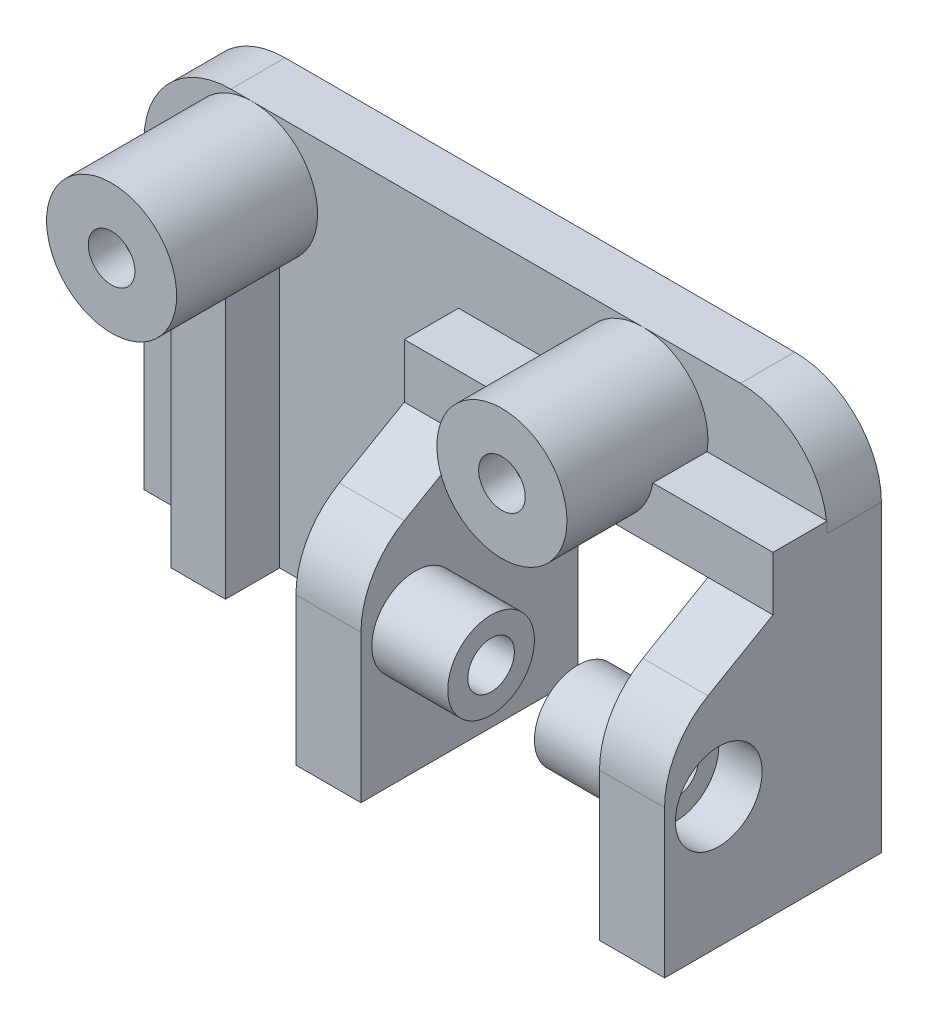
ISO-10303-21;
HEADER;
FILE_DESCRIPTION(('STEP AP214'),'2;1');
FILE_NAME('part.step','',(''),(''),'','','');
FILE_SCHEMA(('AUTOMOTIVE_DESIGN { 1 0 10303 214 1 1 1 1 }'));
ENDSEC;
DATA;
#1=APPLICATION_CONTEXT('core data for automotive mechanical design processes');
#2=APPLICATION_PROTOCOL_DEFINITION('international standard','automotive_design',2000,#1);
#3=PRODUCT_CONTEXT('',#1,'mechanical');
#4=PRODUCT('Part','Part','',(#3));
#5=PRODUCT_RELATED_PRODUCT_CATEGORY('part','',(#4));
#6=PRODUCT_DEFINITION_FORMATION('','',#4);
#7=PRODUCT_DEFINITION_CONTEXT('part definition',#1,'design');
#8=PRODUCT_DEFINITION('design','',#6,#7);
#9=PRODUCT_DEFINITION_SHAPE('','',#8);
#10=(LENGTH_UNIT() NAMED_UNIT(*) SI_UNIT(.MILLI.,.METRE.));
#11=(NAMED_UNIT(*) PLANE_ANGLE_UNIT() SI_UNIT($,.RADIAN.));
#12=(NAMED_UNIT(*) SI_UNIT($,.STERADIAN.) SOLID_ANGLE_UNIT());
#13=UNCERTAINTY_MEASURE_WITH_UNIT(LENGTH_MEASURE(1.E-05),#10,'distance_accuracy_value','');
#14=(GEOMETRIC_REPRESENTATION_CONTEXT(3) GLOBAL_UNCERTAINTY_ASSIGNED_CONTEXT((#13)) GLOBAL_UNIT_ASSIGNED_CONTEXT((#10,
#11,#12)) REPRESENTATION_CONTEXT('',''));
#15=CARTESIAN_POINT('',(0.,0.,0.));
#16=DIRECTION('',(0.,0.,1.));
#17=DIRECTION('',(1.,0.,0.));
#18=AXIS2_PLACEMENT_3D('',#15,#16,#17);
#19=CARTESIAN_POINT('',(8.,28.,5.));
#20=DIRECTION('',(0.,0.,-1.));
#21=DIRECTION('',(-1.,0.,0.));
#22=AXIS2_PLACEMENT_3D('',#19,#20,#21);
#23=PLANE('',#22);
#24=CARTESIAN_POINT('',(10.,30.,5.));
#25=DIRECTION('',(0.,0.,1.));
#26=DIRECTION('',(1.,0.,0.));
#27=AXIS2_PLACEMENT_3D('',#24,#25,#26);
#28=CIRCLE('',#27,6.);
#29=CARTESIAN_POINT('',(12.5,24.5456439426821,5.));
#30=VERTEX_POINT('',#29);
#31=CARTESIAN_POINT('',(10.,36.,5.));
#32=VERTEX_POINT('',#31);
#33=EDGE_CURVE('E498',#30,#32,#28,.T.);
#34=ORIENTED_EDGE('',*,*,#33,.F.);
#35=DIRECTION('',(0.,-1.,0.));
#36=VECTOR('',#35,1.);
#37=CARTESIAN_POINT('',(12.5,36.002,5.));
#38=LINE('',#37,#36);
#39=CARTESIAN_POINT('',(12.5,0.,5.));
#40=VERTEX_POINT('',#39);
#41=EDGE_CURVE('E388',#30,#40,#38,.T.);
#42=ORIENTED_EDGE('',*,*,#41,.T.);
#43=DIRECTION('',(1.,0.,0.));
#44=VECTOR('',#43,1.);
#45=CARTESIAN_POINT('',(0.,0.,5.));
#46=LINE('',#45,#44);
#47=CARTESIAN_POINT('',(29.,0.,5.));
#48=VERTEX_POINT('',#47);
#49=EDGE_CURVE('E515',#40,#48,#46,.T.);
#50=ORIENTED_EDGE('',*,*,#49,.T.);
#51=DIRECTION('',(0.,1.,0.));
#52=VECTOR('',#51,1.);
#53=CARTESIAN_POINT('',(29.,0.,5.));
#54=LINE('',#53,#52);
#55=CARTESIAN_POINT('',(29.,29.,5.));
#56=VERTEX_POINT('',#55);
#57=EDGE_CURVE('E617',#48,#56,#54,.T.);
#58=ORIENTED_EDGE('',*,*,#57,.T.);
#59=DIRECTION('',(1.,0.,0.));
#60=VECTOR('',#59,1.);
#61=CARTESIAN_POINT('',(29.,29.,5.));
#62=LINE('',#61,#60);
#63=CARTESIAN_POINT('',(40.0839202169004,29.,5.));
#64=VERTEX_POINT('',#63);
#65=EDGE_CURVE('E646',#56,#64,#62,.T.);
#66=ORIENTED_EDGE('',*,*,#65,.T.);
#67=CARTESIAN_POINT('',(46.,30.,5.));
#68=DIRECTION('',(0.,0.,1.));
#69=DIRECTION('',(1.,0.,0.));
#70=AXIS2_PLACEMENT_3D('',#67,#68,#69);
#71=CIRCLE('',#70,5.99999999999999);
#72=CARTESIAN_POINT('',(46.,36.,5.));
#73=VERTEX_POINT('',#72);
#74=EDGE_CURVE('E494',#73,#64,#71,.T.);
#75=ORIENTED_EDGE('',*,*,#74,.F.);
#76=DIRECTION('',(-1.,0.,0.));
#77=VECTOR('',#76,1.);
#78=CARTESIAN_POINT('',(8.00000000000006,36.,5.));
#79=LINE('',#78,#77);
#80=EDGE_CURVE('E532',#73,#32,#79,.T.);
#81=ORIENTED_EDGE('',*,*,#80,.T.);
#82=EDGE_LOOP('',(#34,#42,#50,#58,#66,#75,#81));
#83=FACE_BOUND('',#82,.T.);
#84=ADVANCED_FACE('F54',(#83),#23,.F.);
#85=CARTESIAN_POINT('',(29.,0.,5.));
#86=DIRECTION('',(0.,-1.,0.));
#87=DIRECTION('',(0.,0.,-1.));
#88=AXIS2_PLACEMENT_3D('',#85,#86,#87);
#89=PLANE('',#88);
#90=DIRECTION('',(0.,0.,-1.));
#91=VECTOR('',#90,1.);
#92=CARTESIAN_POINT('',(35.,0.,5.));
#93=LINE('',#92,#91);
#94=CARTESIAN_POINT('',(35.,0.,20.));
#95=VERTEX_POINT('',#94);
#96=CARTESIAN_POINT('',(35.,0.,0.));
#97=VERTEX_POINT('',#96);
#98=EDGE_CURVE('E622',#95,#97,#93,.T.);
#99=ORIENTED_EDGE('',*,*,#98,.F.);
#100=DIRECTION('',(1.,0.,0.));
#101=VECTOR('',#100,1.);
#102=CARTESIAN_POINT('',(29.,0.,20.));
#103=LINE('',#102,#101);
#104=CARTESIAN_POINT('',(29.,0.,20.));
#105=VERTEX_POINT('',#104);
#106=EDGE_CURVE('E64',#105,#95,#103,.T.);
#107=ORIENTED_EDGE('',*,*,#106,.F.);
#108=DIRECTION('',(0.,0.,-1.));
#109=VECTOR('',#108,1.);
#110=CARTESIAN_POINT('',(29.,0.,5.));
#111=LINE('',#110,#109);
#112=EDGE_CURVE('E642',#105,#48,#111,.T.);
#113=ORIENTED_EDGE('',*,*,#112,.T.);
#114=ORIENTED_EDGE('',*,*,#49,.F.);
#115=DIRECTION('',(0.,0.,1.));
#116=VECTOR('',#115,1.);
#117=CARTESIAN_POINT('',(12.5,0.,5.));
#118=LINE('',#117,#116);
#119=CARTESIAN_POINT('',(12.5,0.,10.));
#120=VERTEX_POINT('',#119);
#121=EDGE_CURVE('E370',#40,#120,#118,.T.);
#122=ORIENTED_EDGE('',*,*,#121,.T.);
#123=DIRECTION('',(-1.,0.,0.));
#124=VECTOR('',#123,1.);
#125=CARTESIAN_POINT('',(7.5,0.,10.));
#126=LINE('',#125,#124);
#127=CARTESIAN_POINT('',(7.5,0.,10.));
#128=VERTEX_POINT('',#127);
#129=EDGE_CURVE('E366',#120,#128,#126,.T.);
#130=ORIENTED_EDGE('',*,*,#129,.T.);
#131=DIRECTION('',(0.,0.,-1.));
#132=VECTOR('',#131,1.);
#133=CARTESIAN_POINT('',(7.5,0.,5.));
#134=LINE('',#133,#132);
#135=CARTESIAN_POINT('',(7.5,0.,5.));
#136=VERTEX_POINT('',#135);
#137=EDGE_CURVE('E361',#128,#136,#134,.T.);
#138=ORIENTED_EDGE('',*,*,#137,.T.);
#139=CARTESIAN_POINT('',(0.,0.,5.));
#140=VERTEX_POINT('',#139);
#141=EDGE_CURVE('E517',#140,#136,#46,.T.);
#142=ORIENTED_EDGE('',*,*,#141,.F.);
#143=DIRECTION('',(0.,0.,-1.));
#144=VECTOR('',#143,1.);
#145=CARTESIAN_POINT('',(0.,0.,5.));
#146=LINE('',#145,#144);
#147=CARTESIAN_POINT('',(0.,0.,0.));
#148=VERTEX_POINT('',#147);
#149=EDGE_CURVE('E594',#140,#148,#146,.T.);
#150=ORIENTED_EDGE('',*,*,#149,.T.);
#151=DIRECTION('',(1.,0.,0.));
#152=VECTOR('',#151,1.);
#153=CARTESIAN_POINT('',(0.,0.,0.));
#154=LINE('',#153,#152);
#155=EDGE_CURVE('E539',#148,#97,#154,.T.);
#156=ORIENTED_EDGE('',*,*,#155,.T.);
#157=EDGE_LOOP('',(#99,#107,#113,#114,#122,#130,#138,#142,#150,#156));
#158=FACE_BOUND('',#157,.T.);
#159=ADVANCED_FACE('F727',(#158),#89,.T.);
#160=CARTESIAN_POINT('',(29.,0.,20.));
#161=DIRECTION('',(0.,0.,1.));
#162=DIRECTION('',(0.,-1.,0.));
#163=AXIS2_PLACEMENT_3D('',#160,#161,#162);
#164=PLANE('',#163);
#165=DIRECTION('',(0.,-1.,0.));
#166=VECTOR('',#165,1.);
#167=CARTESIAN_POINT('',(35.,0.,20.));
#168=LINE('',#167,#166);
#169=CARTESIAN_POINT('',(35.,13.6076951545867,20.));
#170=VERTEX_POINT('',#169);
#171=EDGE_CURVE('E654',#170,#95,#168,.T.);
#172=ORIENTED_EDGE('',*,*,#171,.F.);
#173=DIRECTION('',(1.,0.,0.));
#174=VECTOR('',#173,1.);
#175=CARTESIAN_POINT('',(29.,13.6076951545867,20.));
#176=LINE('',#175,#174);
#177=CARTESIAN_POINT('',(29.,13.6076951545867,20.));
#178=VERTEX_POINT('',#177);
#179=EDGE_CURVE('E662',#178,#170,#176,.T.);
#180=ORIENTED_EDGE('',*,*,#179,.F.);
#181=DIRECTION('',(0.,-1.,0.));
#182=VECTOR('',#181,1.);
#183=CARTESIAN_POINT('',(29.,0.,20.));
#184=LINE('',#183,#182);
#185=EDGE_CURVE('E638',#178,#105,#184,.T.);
#186=ORIENTED_EDGE('',*,*,#185,.T.);
#187=ORIENTED_EDGE('',*,*,#106,.T.);
#188=EDGE_LOOP('',(#172,#180,#186,#187));
#189=FACE_BOUND('',#188,.T.);
#190=ADVANCED_FACE('F790',(#189),#164,.T.);
#191=CARTESIAN_POINT('',(29.,13.6076951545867,12.));
#192=DIRECTION('',(1.,0.,0.));
#193=DIRECTION('',(0.,0.,-1.));
#194=AXIS2_PLACEMENT_3D('',#191,#192,#193);
#195=CYLINDRICAL_SURFACE('',#194,8.);
#196=CARTESIAN_POINT('',(35.,13.6076951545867,12.));
#197=DIRECTION('',(1.,0.,0.));
#198=DIRECTION('',(0.,0.,-1.));
#199=AXIS2_PLACEMENT_3D('',#196,#197,#198);
#200=CIRCLE('',#199,8.);
#201=CARTESIAN_POINT('',(35.,20.5358983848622,16.));
#202=VERTEX_POINT('',#201);
#203=EDGE_CURVE('E650',#202,#170,#200,.T.);
#204=ORIENTED_EDGE('',*,*,#203,.F.);
#205=DIRECTION('',(1.,0.,0.));
#206=VECTOR('',#205,1.);
#207=CARTESIAN_POINT('',(29.,20.5358983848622,16.));
#208=LINE('',#207,#206);
#209=CARTESIAN_POINT('',(29.,20.5358983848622,16.));
#210=VERTEX_POINT('',#209);
#211=EDGE_CURVE('E665',#210,#202,#208,.T.);
#212=ORIENTED_EDGE('',*,*,#211,.F.);
#213=CARTESIAN_POINT('',(29.,13.6076951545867,12.));
#214=DIRECTION('',(1.,0.,0.));
#215=DIRECTION('',(0.,0.,-1.));
#216=AXIS2_PLACEMENT_3D('',#213,#214,#215);
#217=CIRCLE('',#216,8.);
#218=EDGE_CURVE('E634',#210,#178,#217,.T.);
#219=ORIENTED_EDGE('',*,*,#218,.T.);
#220=ORIENTED_EDGE('',*,*,#179,.T.);
#221=EDGE_LOOP('',(#204,#212,#219,#220));
#222=FACE_BOUND('',#221,.T.);
#223=ADVANCED_FACE('F837',(#222),#195,.T.);
#224=CARTESIAN_POINT('',(29.,24.,10.));
#225=DIRECTION('',(0.,0.866025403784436,0.500000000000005));
#226=DIRECTION('',(0.,-0.500000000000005,0.866025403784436));
#227=AXIS2_PLACEMENT_3D('',#224,#225,#226);
#228=PLANE('',#227);
#229=DIRECTION('',(0.,-0.500000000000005,0.866025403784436));
#230=VECTOR('',#229,1.);
#231=CARTESIAN_POINT('',(35.,24.,10.));
#232=LINE('',#231,#230);
#233=CARTESIAN_POINT('',(35.,24.,10.));
#234=VERTEX_POINT('',#233);
#235=EDGE_CURVE('E605',#234,#202,#232,.T.);
#236=ORIENTED_EDGE('',*,*,#235,.F.);
#237=DIRECTION('',(1.,0.,0.));
#238=VECTOR('',#237,1.);
#239=CARTESIAN_POINT('',(29.,24.,10.));
#240=LINE('',#239,#238);
#241=CARTESIAN_POINT('',(29.,24.,10.));
#242=VERTEX_POINT('',#241);
#243=EDGE_CURVE('E668',#242,#234,#240,.T.);
#244=ORIENTED_EDGE('',*,*,#243,.F.);
#245=DIRECTION('',(0.,-0.500000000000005,0.866025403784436));
#246=VECTOR('',#245,1.);
#247=CARTESIAN_POINT('',(29.,24.,10.));
#248=LINE('',#247,#246);
#249=EDGE_CURVE('E630',#242,#210,#248,.T.);
#250=ORIENTED_EDGE('',*,*,#249,.T.);
#251=ORIENTED_EDGE('',*,*,#211,.T.);
#252=EDGE_LOOP('',(#236,#244,#250,#251));
#253=FACE_BOUND('',#252,.T.);
#254=ADVANCED_FACE('F841',(#253),#228,.T.);
#255=CARTESIAN_POINT('',(29.,24.,10.));
#256=DIRECTION('',(0.,0.,1.));
#257=DIRECTION('',(1.,0.,0.));
#258=AXIS2_PLACEMENT_3D('',#255,#256,#257);
#259=PLANE('',#258);
#260=ORIENTED_EDGE('',*,*,#243,.T.);
#261=DIRECTION('',(-1.,0.,0.));
#262=VECTOR('',#261,1.);
#263=CARTESIAN_POINT('',(63.002,24.,10.));
#264=LINE('',#263,#262);
#265=CARTESIAN_POINT('',(46.,24.,10.));
#266=VERTEX_POINT('',#265);
#267=EDGE_CURVE('E606',#266,#234,#264,.T.);
#268=ORIENTED_EDGE('',*,*,#267,.F.);
#269=CARTESIAN_POINT('',(46.,30.,10.));
#270=DIRECTION('',(0.,0.,-1.));
#271=DIRECTION('',(-1.,0.,0.));
#272=AXIS2_PLACEMENT_3D('',#269,#270,#271);
#273=CIRCLE('',#272,5.99999999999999);
#274=CARTESIAN_POINT('',(40.0839202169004,29.,10.));
#275=VERTEX_POINT('',#274);
#276=EDGE_CURVE('E601',#275,#266,#273,.F.);
#277=ORIENTED_EDGE('',*,*,#276,.F.);
#278=DIRECTION('',(1.,0.,0.));
#279=VECTOR('',#278,1.);
#280=CARTESIAN_POINT('',(29.,29.,10.));
#281=LINE('',#280,#279);
#282=CARTESIAN_POINT('',(29.,29.,10.));
#283=VERTEX_POINT('',#282);
#284=EDGE_CURVE('E672',#283,#275,#281,.T.);
#285=ORIENTED_EDGE('',*,*,#284,.F.);
#286=DIRECTION('',(0.,-1.,0.));
#287=VECTOR('',#286,1.);
#288=CARTESIAN_POINT('',(29.,24.,10.));
#289=LINE('',#288,#287);
#290=EDGE_CURVE('E626',#283,#242,#289,.T.);
#291=ORIENTED_EDGE('',*,*,#290,.T.);
#292=EDGE_LOOP('',(#260,#268,#277,#285,#291));
#293=FACE_BOUND('',#292,.T.);
#294=ADVANCED_FACE('F744',(#293),#259,.T.);
#295=CARTESIAN_POINT('',(29.,29.,5.));
#296=DIRECTION('',(0.,1.,0.));
#297=DIRECTION('',(0.,0.,1.));
#298=AXIS2_PLACEMENT_3D('',#295,#296,#297);
#299=PLANE('',#298);
#300=ORIENTED_EDGE('',*,*,#284,.T.);
#301=DIRECTION('',(0.,0.,-1.));
#302=VECTOR('',#301,1.);
#303=CARTESIAN_POINT('',(40.0839202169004,29.,18.));
#304=LINE('',#303,#302);
#305=EDGE_CURVE('E610',#64,#275,#304,.F.);
#306=ORIENTED_EDGE('',*,*,#305,.F.);
#307=ORIENTED_EDGE('',*,*,#65,.F.);
#308=DIRECTION('',(0.,0.,1.));
#309=VECTOR('',#308,1.);
#310=CARTESIAN_POINT('',(29.,29.,5.));
#311=LINE('',#310,#309);
#312=EDGE_CURVE('E621',#56,#283,#311,.T.);
#313=ORIENTED_EDGE('',*,*,#312,.T.);
#314=EDGE_LOOP('',(#300,#306,#307,#313));
#315=FACE_BOUND('',#314,.T.);
#316=ADVANCED_FACE('F56',(#315),#299,.T.);
#317=CARTESIAN_POINT('',(29.,13.6076951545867,12.));
#318=DIRECTION('',(1.,0.,0.));
#319=DIRECTION('',(0.,0.,-1.));
#320=AXIS2_PLACEMENT_3D('',#317,#318,#319);
#321=PLANE('',#320);
#322=DIRECTION('',(0.,1.,0.));
#323=VECTOR('',#322,1.);
#324=CARTESIAN_POINT('',(29.,9.6905989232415,19.));
#325=LINE('',#324,#323);
#326=CARTESIAN_POINT('',(29.,9.6905989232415,19.));
#327=VERTEX_POINT('',#326);
#328=CARTESIAN_POINT('',(29.,14.3094010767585,19.));
#329=VERTEX_POINT('',#328);
#330=EDGE_CURVE('E312',#327,#329,#325,.T.);
#331=ORIENTED_EDGE('',*,*,#330,.F.);
#332=DIRECTION('',(0.,0.5,0.866025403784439));
#333=VECTOR('',#332,1.);
#334=CARTESIAN_POINT('',(29.,7.381197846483,15.));
#335=LINE('',#334,#333);
#336=CARTESIAN_POINT('',(29.,7.381197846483,15.));
#337=VERTEX_POINT('',#336);
#338=EDGE_CURVE('E71',#337,#327,#335,.T.);
#339=ORIENTED_EDGE('',*,*,#338,.F.);
#340=DIRECTION('',(0.,-0.500000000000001,0.866025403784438));
#341=VECTOR('',#340,1.);
#342=CARTESIAN_POINT('',(29.,9.6905989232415,11.));
#343=LINE('',#342,#341);
#344=CARTESIAN_POINT('',(29.,9.6905989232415,11.));
#345=VERTEX_POINT('',#344);
#346=EDGE_CURVE('E289',#345,#337,#343,.T.);
#347=ORIENTED_EDGE('',*,*,#346,.F.);
#348=DIRECTION('',(0.,-1.,0.));
#349=VECTOR('',#348,1.);
#350=CARTESIAN_POINT('',(29.,14.3094010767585,11.));
#351=LINE('',#350,#349);
#352=CARTESIAN_POINT('',(29.,14.3094010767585,11.));
#353=VERTEX_POINT('',#352);
#354=EDGE_CURVE('E293',#353,#345,#351,.T.);
#355=ORIENTED_EDGE('',*,*,#354,.F.);
#356=DIRECTION('',(0.,-0.5,-0.866025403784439));
#357=VECTOR('',#356,1.);
#358=CARTESIAN_POINT('',(29.,16.618802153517,15.));
#359=LINE('',#358,#357);
#360=CARTESIAN_POINT('',(29.,16.618802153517,15.));
#361=VERTEX_POINT('',#360);
#362=EDGE_CURVE('E319',#361,#353,#359,.T.);
#363=ORIENTED_EDGE('',*,*,#362,.F.);
#364=DIRECTION('',(0.,0.5,-0.866025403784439));
#365=VECTOR('',#364,1.);
#366=CARTESIAN_POINT('',(29.,14.3094010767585,19.));
#367=LINE('',#366,#365);
#368=EDGE_CURVE('E315',#329,#361,#367,.T.);
#369=ORIENTED_EDGE('',*,*,#368,.F.);
#370=EDGE_LOOP('',(#331,#339,#347,#355,#363,#369));
#371=FACE_BOUND('',#370,.T.);
#372=ORIENTED_EDGE('',*,*,#57,.F.);
#373=ORIENTED_EDGE('',*,*,#112,.F.);
#374=ORIENTED_EDGE('',*,*,#185,.F.);
#375=ORIENTED_EDGE('',*,*,#218,.F.);
#376=ORIENTED_EDGE('',*,*,#249,.F.);
#377=ORIENTED_EDGE('',*,*,#290,.F.);
#378=ORIENTED_EDGE('',*,*,#312,.F.);
#379=EDGE_LOOP('',(#372,#373,#374,#375,#376,#377,#378));
#380=FACE_BOUND('',#379,.T.);
#381=ADVANCED_FACE('F738',(#371,#380),#321,.F.);
#382=CARTESIAN_POINT('',(35.,13.6076951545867,12.));
#383=DIRECTION('',(1.,0.,0.));
#384=DIRECTION('',(0.,0.,-1.));
#385=AXIS2_PLACEMENT_3D('',#382,#383,#384);
#386=PLANE('',#385);
#387=CARTESIAN_POINT('',(35.,12.,15.));
#388=DIRECTION('',(1.,0.,0.));
#389=DIRECTION('',(0.,0.,-1.));
#390=AXIS2_PLACEMENT_3D('',#387,#388,#389);
#391=CIRCLE('',#390,4.);
#392=CARTESIAN_POINT('',(35.,12.,11.));
#393=VERTEX_POINT('',#392);
#394=EDGE_CURVE('E345',#393,#393,#391,.T.);
#395=ORIENTED_EDGE('',*,*,#394,.F.);
#396=EDGE_LOOP('',(#395));
#397=FACE_BOUND('',#396,.T.);
#398=DIRECTION('',(0.,0.,-1.));
#399=VECTOR('',#398,1.);
#400=CARTESIAN_POINT('',(35.,24.,5.));
#401=LINE('',#400,#399);
#402=CARTESIAN_POINT('',(35.,24.,0.));
#403=VERTEX_POINT('',#402);
#404=EDGE_CURVE('E602',#234,#403,#401,.T.);
#405=ORIENTED_EDGE('',*,*,#404,.F.);
#406=ORIENTED_EDGE('',*,*,#235,.T.);
#407=ORIENTED_EDGE('',*,*,#203,.T.);
#408=ORIENTED_EDGE('',*,*,#171,.T.);
#409=ORIENTED_EDGE('',*,*,#98,.T.);
#410=DIRECTION('',(0.,1.,0.));
#411=VECTOR('',#410,1.);
#412=CARTESIAN_POINT('',(35.,0.,0.));
#413=LINE('',#412,#411);
#414=EDGE_CURVE('E543',#97,#403,#413,.T.);
#415=ORIENTED_EDGE('',*,*,#414,.T.);
#416=EDGE_LOOP('',(#405,#406,#407,#408,#409,#415));
#417=FACE_BOUND('',#416,.T.);
#418=ADVANCED_FACE('F828',(#397,#417),#386,.T.);
#419=CARTESIAN_POINT('',(63.002,24.,5.));
#420=DIRECTION('',(0.,1.,0.));
#421=DIRECTION('',(0.,0.,1.));
#422=AXIS2_PLACEMENT_3D('',#419,#420,#421);
#423=PLANE('',#422);
#424=DIRECTION('',(1.,0.,0.));
#425=VECTOR('',#424,1.);
#426=CARTESIAN_POINT('',(-0.002000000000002,24.,10.));
#427=LINE('',#426,#425);
#428=CARTESIAN_POINT('',(57.,24.,10.));
#429=VERTEX_POINT('',#428);
#430=EDGE_CURVE('E453',#266,#429,#427,.T.);
#431=ORIENTED_EDGE('',*,*,#430,.F.);
#432=ORIENTED_EDGE('',*,*,#267,.T.);
#433=ORIENTED_EDGE('',*,*,#404,.T.);
#434=DIRECTION('',(1.,0.,0.));
#435=VECTOR('',#434,1.);
#436=CARTESIAN_POINT('',(35.,24.,0.));
#437=LINE('',#436,#435);
#438=CARTESIAN_POINT('',(57.,24.,0.));
#439=VERTEX_POINT('',#438);
#440=EDGE_CURVE('E547',#403,#439,#437,.T.);
#441=ORIENTED_EDGE('',*,*,#440,.T.);
#442=DIRECTION('',(0.,0.,-1.));
#443=VECTOR('',#442,1.);
#444=CARTESIAN_POINT('',(57.,24.,5.));
#445=LINE('',#444,#443);
#446=EDGE_CURVE('E590',#429,#439,#445,.T.);
#447=ORIENTED_EDGE('',*,*,#446,.F.);
#448=EDGE_LOOP('',(#431,#432,#433,#441,#447));
#449=FACE_BOUND('',#448,.T.);
#450=ADVANCED_FACE('F751',(#449),#423,.F.);
#451=DIRECTION('',(1.,0.,0.));
#452=VECTOR('',#451,1.);
#453=CARTESIAN_POINT('',(-0.002000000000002,29.,5.));
#454=LINE('',#453,#452);
#455=CARTESIAN_POINT('',(51.9160797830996,29.,5.));
#456=VERTEX_POINT('',#455);
#457=CARTESIAN_POINT('',(62.9372539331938,29.,5.));
#458=VERTEX_POINT('',#457);
#459=EDGE_CURVE('E446',#456,#458,#454,.T.);
#460=ORIENTED_EDGE('',*,*,#459,.T.);
#461=CARTESIAN_POINT('',(55.,28.,5.));
#462=DIRECTION('',(0.,0.,1.));
#463=DIRECTION('',(-1.,0.,0.));
#464=AXIS2_PLACEMENT_3D('',#461,#462,#463);
#465=CIRCLE('',#464,8.);
#466=CARTESIAN_POINT('',(54.9999999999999,36.,5.));
#467=VERTEX_POINT('',#466);
#468=EDGE_CURVE('E521',#458,#467,#465,.T.);
#469=ORIENTED_EDGE('',*,*,#468,.T.);
#470=EDGE_CURVE('E527',#467,#73,#79,.T.);
#471=ORIENTED_EDGE('',*,*,#470,.T.);
#472=CARTESIAN_POINT('',(46.,30.,5.));
#473=DIRECTION('',(0.,0.,-1.));
#474=DIRECTION('',(-1.,0.,0.));
#475=AXIS2_PLACEMENT_3D('',#472,#473,#474);
#476=CIRCLE('',#475,5.99999999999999);
#477=EDGE_CURVE('E598',#456,#73,#476,.F.);
#478=ORIENTED_EDGE('',*,*,#477,.F.);
#479=EDGE_LOOP('',(#460,#469,#471,#478));
#480=FACE_BOUND('',#479,.T.);
#481=ADVANCED_FACE('F692',(#480),#23,.F.);
#482=CARTESIAN_POINT('',(46.,30.,18.));
#483=DIRECTION('',(0.,0.,-1.));
#484=DIRECTION('',(-1.,0.,0.));
#485=AXIS2_PLACEMENT_3D('',#482,#483,#484);
#486=CYLINDRICAL_SURFACE('',#485,5.99999999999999);
#487=ORIENTED_EDGE('',*,*,#276,.T.);
#488=CARTESIAN_POINT('',(46.,30.,10.));
#489=DIRECTION('',(0.,0.,-1.));
#490=DIRECTION('',(-1.,0.,0.));
#491=AXIS2_PLACEMENT_3D('',#488,#489,#490);
#492=CIRCLE('',#491,5.99999999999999);
#493=CARTESIAN_POINT('',(51.9160797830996,29.,10.));
#494=VERTEX_POINT('',#493);
#495=EDGE_CURVE('E457',#266,#494,#492,.F.);
#496=ORIENTED_EDGE('',*,*,#495,.T.);
#497=DIRECTION('',(0.,0.,-1.));
#498=VECTOR('',#497,1.);
#499=CARTESIAN_POINT('',(51.9160797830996,29.,18.));
#500=LINE('',#499,#498);
#501=EDGE_CURVE('E433',#494,#456,#500,.T.);
#502=ORIENTED_EDGE('',*,*,#501,.T.);
#503=ORIENTED_EDGE('',*,*,#477,.T.);
#504=ORIENTED_EDGE('',*,*,#74,.T.);
#505=ORIENTED_EDGE('',*,*,#305,.T.);
#506=EDGE_LOOP('',(#487,#496,#502,#503,#504,#505));
#507=FACE_BOUND('',#506,.T.);
#508=CARTESIAN_POINT('',(46.,30.,18.));
#509=DIRECTION('',(0.,0.,1.));
#510=DIRECTION('',(1.,0.,0.));
#511=AXIS2_PLACEMENT_3D('',#508,#509,#510);
#512=CIRCLE('',#511,5.99999999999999);
#513=CARTESIAN_POINT('',(52.,30.,18.));
#514=VERTEX_POINT('',#513);
#515=EDGE_CURVE('E482',#514,#514,#512,.T.);
#516=ORIENTED_EDGE('',*,*,#515,.F.);
#517=EDGE_LOOP('',(#516));
#518=FACE_BOUND('',#517,.T.);
#519=ADVANCED_FACE('F686',(#507,#518),#486,.T.);
#520=CARTESIAN_POINT('',(0.,0.,5.));
#521=DIRECTION('',(1.,0.,0.));
#522=DIRECTION('',(0.,0.,-1.));
#523=AXIS2_PLACEMENT_3D('',#520,#521,#522);
#524=PLANE('',#523);
#525=DIRECTION('',(0.,-1.,0.));
#526=VECTOR('',#525,1.);
#527=CARTESIAN_POINT('',(0.,0.,0.));
#528=LINE('',#527,#526);
#529=CARTESIAN_POINT('',(0.,28.,0.));
#530=VERTEX_POINT('',#529);
#531=EDGE_CURVE('E506',#530,#148,#528,.T.);
#532=ORIENTED_EDGE('',*,*,#531,.T.);
#533=ORIENTED_EDGE('',*,*,#149,.F.);
#534=DIRECTION('',(0.,-1.,0.));
#535=VECTOR('',#534,1.);
#536=CARTESIAN_POINT('',(0.,0.,5.));
#537=LINE('',#536,#535);
#538=CARTESIAN_POINT('',(0.,28.,5.));
#539=VERTEX_POINT('',#538);
#540=EDGE_CURVE('E511',#539,#140,#537,.T.);
#541=ORIENTED_EDGE('',*,*,#540,.F.);
#542=DIRECTION('',(0.,0.,-1.));
#543=VECTOR('',#542,1.);
#544=CARTESIAN_POINT('',(0.,28.,5.));
#545=LINE('',#544,#543);
#546=EDGE_CURVE('E535',#539,#530,#545,.T.);
#547=ORIENTED_EDGE('',*,*,#546,.T.);
#548=EDGE_LOOP('',(#532,#533,#541,#547));
#549=FACE_BOUND('',#548,.T.);
#550=ADVANCED_FACE('F821',(#549),#524,.F.);
#551=CARTESIAN_POINT('',(57.,0.,5.));
#552=DIRECTION('',(1.,0.,0.));
#553=DIRECTION('',(0.,0.,-1.));
#554=AXIS2_PLACEMENT_3D('',#551,#552,#553);
#555=PLANE('',#554);
#556=CARTESIAN_POINT('',(57.,12.,15.));
#557=DIRECTION('',(1.,0.,0.));
#558=DIRECTION('',(0.,0.,-1.));
#559=AXIS2_PLACEMENT_3D('',#556,#557,#558);
#560=CIRCLE('',#559,4.);
#561=CARTESIAN_POINT('',(57.,12.,11.));
#562=VERTEX_POINT('',#561);
#563=EDGE_CURVE('E13',#562,#562,#560,.F.);
#564=ORIENTED_EDGE('',*,*,#563,.F.);
#565=EDGE_LOOP('',(#564));
#566=FACE_BOUND('',#565,.T.);
#567=DIRECTION('',(0.,-1.,0.));
#568=VECTOR('',#567,1.);
#569=CARTESIAN_POINT('',(57.,0.,0.));
#570=LINE('',#569,#568);
#571=CARTESIAN_POINT('',(57.,0.,0.));
#572=VERTEX_POINT('',#571);
#573=EDGE_CURVE('E550',#439,#572,#570,.T.);
#574=ORIENTED_EDGE('',*,*,#573,.T.);
#575=DIRECTION('',(0.,0.,-1.));
#576=VECTOR('',#575,1.);
#577=CARTESIAN_POINT('',(57.,0.,5.));
#578=LINE('',#577,#576);
#579=CARTESIAN_POINT('',(57.,0.,20.));
#580=VERTEX_POINT('',#579);
#581=EDGE_CURVE('E586',#580,#572,#578,.T.);
#582=ORIENTED_EDGE('',*,*,#581,.F.);
#583=DIRECTION('',(0.,-1.,0.));
#584=VECTOR('',#583,1.);
#585=CARTESIAN_POINT('',(57.,0.,20.));
#586=LINE('',#585,#584);
#587=CARTESIAN_POINT('',(57.,13.6076951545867,20.));
#588=VERTEX_POINT('',#587);
#589=EDGE_CURVE('E403',#588,#580,#586,.T.);
#590=ORIENTED_EDGE('',*,*,#589,.F.);
#591=CARTESIAN_POINT('',(57.,13.6076951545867,12.));
#592=DIRECTION('',(1.,0.,0.));
#593=DIRECTION('',(0.,0.,-1.));
#594=AXIS2_PLACEMENT_3D('',#591,#592,#593);
#595=CIRCLE('',#594,8.);
#596=CARTESIAN_POINT('',(57.,20.5358983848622,16.));
#597=VERTEX_POINT('',#596);
#598=EDGE_CURVE('E398',#597,#588,#595,.T.);
#599=ORIENTED_EDGE('',*,*,#598,.F.);
#600=DIRECTION('',(0.,-0.500000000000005,0.866025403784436));
#601=VECTOR('',#600,1.);
#602=CARTESIAN_POINT('',(57.,24.,10.));
#603=LINE('',#602,#601);
#604=EDGE_CURVE('E394',#429,#597,#603,.T.);
#605=ORIENTED_EDGE('',*,*,#604,.F.);
#606=ORIENTED_EDGE('',*,*,#446,.T.);
#607=EDGE_LOOP('',(#574,#582,#590,#599,#605,#606));
#608=FACE_BOUND('',#607,.T.);
#609=ADVANCED_FACE('F761',(#566,#608),#555,.F.);
#610=CARTESIAN_POINT('',(57.,0.,5.));
#611=DIRECTION('',(0.,1.,0.));
#612=DIRECTION('',(0.,0.,1.));
#613=AXIS2_PLACEMENT_3D('',#610,#611,#612);
#614=PLANE('',#613);
#615=DIRECTION('',(1.,0.,0.));
#616=VECTOR('',#615,1.);
#617=CARTESIAN_POINT('',(57.,0.,0.));
#618=LINE('',#617,#616);
#619=CARTESIAN_POINT('',(63.,0.,0.));
#620=VERTEX_POINT('',#619);
#621=EDGE_CURVE('E553',#572,#620,#618,.T.);
#622=ORIENTED_EDGE('',*,*,#621,.T.);
#623=DIRECTION('',(0.,0.,-1.));
#624=VECTOR('',#623,1.);
#625=CARTESIAN_POINT('',(63.,0.,5.));
#626=LINE('',#625,#624);
#627=CARTESIAN_POINT('',(63.,0.,20.));
#628=VERTEX_POINT('',#627);
#629=EDGE_CURVE('E582',#628,#620,#626,.T.);
#630=ORIENTED_EDGE('',*,*,#629,.F.);
#631=DIRECTION('',(1.,0.,0.));
#632=VECTOR('',#631,1.);
#633=CARTESIAN_POINT('',(57.,0.,20.));
#634=LINE('',#633,#632);
#635=EDGE_CURVE('E429',#580,#628,#634,.T.);
#636=ORIENTED_EDGE('',*,*,#635,.F.);
#637=ORIENTED_EDGE('',*,*,#581,.T.);
#638=EDGE_LOOP('',(#622,#630,#636,#637));
#639=FACE_BOUND('',#638,.T.);
#640=ADVANCED_FACE('F814',(#639),#614,.F.);
#641=CARTESIAN_POINT('',(63.,0.,5.));
#642=DIRECTION('',(-1.,0.,0.));
#643=DIRECTION('',(0.,0.,1.));
#644=AXIS2_PLACEMENT_3D('',#641,#642,#643);
#645=PLANE('',#644);
#646=CARTESIAN_POINT('',(63.,12.,15.));
#647=DIRECTION('',(1.,0.,0.));
#648=DIRECTION('',(0.,0.,-1.));
#649=AXIS2_PLACEMENT_3D('',#646,#647,#648);
#650=CIRCLE('',#649,4.);
#651=CARTESIAN_POINT('',(63.,12.,11.));
#652=VERTEX_POINT('',#651);
#653=EDGE_CURVE('E329',#652,#652,#650,.T.);
#654=ORIENTED_EDGE('',*,*,#653,.F.);
#655=EDGE_LOOP('',(#654));
#656=FACE_BOUND('',#655,.T.);
#657=DIRECTION('',(0.,1.,0.));
#658=VECTOR('',#657,1.);
#659=CARTESIAN_POINT('',(63.,0.,0.));
#660=LINE('',#659,#658);
#661=CARTESIAN_POINT('',(63.,28.,0.));
#662=VERTEX_POINT('',#661);
#663=EDGE_CURVE('E556',#620,#662,#660,.T.);
#664=ORIENTED_EDGE('',*,*,#663,.T.);
#665=DIRECTION('',(0.,0.,-1.));
#666=VECTOR('',#665,1.);
#667=CARTESIAN_POINT('',(63.,28.,5.));
#668=LINE('',#667,#666);
#669=CARTESIAN_POINT('',(63.,28.,5.));
#670=VERTEX_POINT('',#669);
#671=EDGE_CURVE('E578',#670,#662,#668,.T.);
#672=ORIENTED_EDGE('',*,*,#671,.F.);
#673=DIRECTION('',(0.,1.,0.));
#674=VECTOR('',#673,1.);
#675=CARTESIAN_POINT('',(63.,0.,5.));
#676=LINE('',#675,#674);
#677=CARTESIAN_POINT('',(63.,29.,5.));
#678=VERTEX_POINT('',#677);
#679=EDGE_CURVE('E365',#670,#678,#676,.T.);
#680=ORIENTED_EDGE('',*,*,#679,.T.);
#681=DIRECTION('',(0.,0.,1.));
#682=VECTOR('',#681,1.);
#683=CARTESIAN_POINT('',(63.,29.,5.));
#684=LINE('',#683,#682);
#685=CARTESIAN_POINT('',(63.,29.,10.));
#686=VERTEX_POINT('',#685);
#687=EDGE_CURVE('E410',#678,#686,#684,.T.);
#688=ORIENTED_EDGE('',*,*,#687,.T.);
#689=DIRECTION('',(0.,-1.,0.));
#690=VECTOR('',#689,1.);
#691=CARTESIAN_POINT('',(63.,24.,10.));
#692=LINE('',#691,#690);
#693=CARTESIAN_POINT('',(63.,24.,10.));
#694=VERTEX_POINT('',#693);
#695=EDGE_CURVE('E414',#686,#694,#692,.T.);
#696=ORIENTED_EDGE('',*,*,#695,.T.);
#697=DIRECTION('',(0.,-0.500000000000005,0.866025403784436));
#698=VECTOR('',#697,1.);
#699=CARTESIAN_POINT('',(63.,24.,10.));
#700=LINE('',#699,#698);
#701=CARTESIAN_POINT('',(63.,20.5358983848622,16.));
#702=VERTEX_POINT('',#701);
#703=EDGE_CURVE('E418',#694,#702,#700,.T.);
#704=ORIENTED_EDGE('',*,*,#703,.T.);
#705=CARTESIAN_POINT('',(63.,13.6076951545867,12.));
#706=DIRECTION('',(1.,0.,0.));
#707=DIRECTION('',(0.,0.,-1.));
#708=AXIS2_PLACEMENT_3D('',#705,#706,#707);
#709=CIRCLE('',#708,8.);
#710=CARTESIAN_POINT('',(63.,13.6076951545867,20.));
#711=VERTEX_POINT('',#710);
#712=EDGE_CURVE('E422',#702,#711,#709,.T.);
#713=ORIENTED_EDGE('',*,*,#712,.T.);
#714=DIRECTION('',(0.,-1.,0.));
#715=VECTOR('',#714,1.);
#716=CARTESIAN_POINT('',(63.,0.,20.));
#717=LINE('',#716,#715);
#718=EDGE_CURVE('E399',#711,#628,#717,.T.);
#719=ORIENTED_EDGE('',*,*,#718,.T.);
#720=ORIENTED_EDGE('',*,*,#629,.T.);
#721=EDGE_LOOP('',(#664,#672,#680,#688,#696,#704,#713,#719,#720));
#722=FACE_BOUND('',#721,.T.);
#723=ADVANCED_FACE('F768',(#656,#722),#645,.F.);
#724=CARTESIAN_POINT('',(55.,28.,5.));
#725=DIRECTION('',(0.,0.,-1.));
#726=DIRECTION('',(-1.,0.,0.));
#727=AXIS2_PLACEMENT_3D('',#724,#725,#726);
#728=CYLINDRICAL_SURFACE('',#727,8.);
#729=CARTESIAN_POINT('',(55.,28.,0.));
#730=DIRECTION('',(0.,0.,1.));
#731=DIRECTION('',(-1.,0.,0.));
#732=AXIS2_PLACEMENT_3D('',#729,#730,#731);
#733=CIRCLE('',#732,8.);
#734=CARTESIAN_POINT('',(54.9999999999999,36.,0.));
#735=VERTEX_POINT('',#734);
#736=EDGE_CURVE('E559',#662,#735,#733,.T.);
#737=ORIENTED_EDGE('',*,*,#736,.T.);
#738=DIRECTION('',(0.,0.,-1.));
#739=VECTOR('',#738,1.);
#740=CARTESIAN_POINT('',(54.9999999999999,36.,5.));
#741=LINE('',#740,#739);
#742=EDGE_CURVE('E574',#467,#735,#741,.T.);
#743=ORIENTED_EDGE('',*,*,#742,.F.);
#744=ORIENTED_EDGE('',*,*,#468,.F.);
#745=EDGE_CURVE('E522',#670,#458,#465,.T.);
#746=ORIENTED_EDGE('',*,*,#745,.F.);
#747=ORIENTED_EDGE('',*,*,#671,.T.);
#748=EDGE_LOOP('',(#737,#743,#744,#746,#747));
#749=FACE_BOUND('',#748,.T.);
#750=ADVANCED_FACE('F704',(#749),#728,.T.);
#751=CARTESIAN_POINT('',(8.00000000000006,36.,5.));
#752=DIRECTION('',(0.,-1.,0.));
#753=DIRECTION('',(0.,0.,-1.));
#754=AXIS2_PLACEMENT_3D('',#751,#752,#753);
#755=PLANE('',#754);
#756=DIRECTION('',(-1.,0.,0.));
#757=VECTOR('',#756,1.);
#758=CARTESIAN_POINT('',(8.00000000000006,36.,0.));
#759=LINE('',#758,#757);
#760=CARTESIAN_POINT('',(8.00000000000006,36.,0.));
#761=VERTEX_POINT('',#760);
#762=EDGE_CURVE('E562',#735,#761,#759,.T.);
#763=ORIENTED_EDGE('',*,*,#762,.T.);
#764=DIRECTION('',(0.,0.,-1.));
#765=VECTOR('',#764,1.);
#766=CARTESIAN_POINT('',(8.00000000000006,36.,5.));
#767=LINE('',#766,#765);
#768=CARTESIAN_POINT('',(8.00000000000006,36.,5.));
#769=VERTEX_POINT('',#768);
#770=EDGE_CURVE('E570',#769,#761,#767,.T.);
#771=ORIENTED_EDGE('',*,*,#770,.F.);
#772=EDGE_CURVE('E526',#32,#769,#79,.T.);
#773=ORIENTED_EDGE('',*,*,#772,.F.);
#774=ORIENTED_EDGE('',*,*,#80,.F.);
#775=ORIENTED_EDGE('',*,*,#470,.F.);
#776=ORIENTED_EDGE('',*,*,#742,.T.);
#777=EDGE_LOOP('',(#763,#771,#773,#774,#775,#776));
#778=FACE_BOUND('',#777,.T.);
#779=ADVANCED_FACE('F719',(#778),#755,.F.);
#780=CARTESIAN_POINT('',(8.,28.,5.));
#781=DIRECTION('',(0.,0.,-1.));
#782=DIRECTION('',(-1.,0.,0.));
#783=AXIS2_PLACEMENT_3D('',#780,#781,#782);
#784=CYLINDRICAL_SURFACE('',#783,8.);
#785=CARTESIAN_POINT('',(8.,28.,0.));
#786=DIRECTION('',(0.,0.,1.));
#787=DIRECTION('',(-1.,0.,0.));
#788=AXIS2_PLACEMENT_3D('',#785,#786,#787);
#789=CIRCLE('',#788,8.);
#790=EDGE_CURVE('E516',#761,#530,#789,.T.);
#791=ORIENTED_EDGE('',*,*,#790,.T.);
#792=ORIENTED_EDGE('',*,*,#546,.F.);
#793=CARTESIAN_POINT('',(8.,28.,5.));
#794=DIRECTION('',(0.,0.,1.));
#795=DIRECTION('',(-1.,0.,0.));
#796=AXIS2_PLACEMENT_3D('',#793,#794,#795);
#797=CIRCLE('',#796,8.);
#798=EDGE_CURVE('E531',#769,#539,#797,.T.);
#799=ORIENTED_EDGE('',*,*,#798,.F.);
#800=ORIENTED_EDGE('',*,*,#770,.T.);
#801=EDGE_LOOP('',(#791,#792,#799,#800));
#802=FACE_BOUND('',#801,.T.);
#803=ADVANCED_FACE('F797',(#802),#784,.T.);
#804=ORIENTED_EDGE('',*,*,#141,.T.);
#805=DIRECTION('',(0.,-1.,0.));
#806=VECTOR('',#805,1.);
#807=CARTESIAN_POINT('',(7.5,36.002,5.));
#808=LINE('',#807,#806);
#809=CARTESIAN_POINT('',(7.5,24.5456439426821,5.));
#810=VERTEX_POINT('',#809);
#811=EDGE_CURVE('E377',#810,#136,#808,.T.);
#812=ORIENTED_EDGE('',*,*,#811,.F.);
#813=EDGE_CURVE('E507',#32,#810,#28,.T.);
#814=ORIENTED_EDGE('',*,*,#813,.F.);
#815=ORIENTED_EDGE('',*,*,#772,.T.);
#816=ORIENTED_EDGE('',*,*,#798,.T.);
#817=ORIENTED_EDGE('',*,*,#540,.T.);
#818=EDGE_LOOP('',(#804,#812,#814,#815,#816,#817));
#819=FACE_BOUND('',#818,.T.);
#820=ADVANCED_FACE('F723',(#819),#23,.F.);
#821=CARTESIAN_POINT('',(8.,28.,0.));
#822=DIRECTION('',(0.,0.,-1.));
#823=DIRECTION('',(-1.,0.,0.));
#824=AXIS2_PLACEMENT_3D('',#821,#822,#823);
#825=PLANE('',#824);
#826=CARTESIAN_POINT('',(46.,30.,0.));
#827=DIRECTION('',(0.,0.,-1.));
#828=DIRECTION('',(-1.,0.,0.));
#829=AXIS2_PLACEMENT_3D('',#826,#827,#828);
#830=CIRCLE('',#829,4.00000000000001);
#831=CARTESIAN_POINT('',(42.,30.,0.));
#832=VERTEX_POINT('',#831);
#833=EDGE_CURVE('E483',#832,#832,#830,.T.);
#834=ORIENTED_EDGE('',*,*,#833,.F.);
#835=EDGE_LOOP('',(#834));
#836=FACE_BOUND('',#835,.T.);
#837=CARTESIAN_POINT('',(10.,30.,0.));
#838=DIRECTION('',(0.,0.,-1.));
#839=DIRECTION('',(-1.,0.,0.));
#840=AXIS2_PLACEMENT_3D('',#837,#838,#839);
#841=CIRCLE('',#840,4.);
#842=CARTESIAN_POINT('',(6.,30.,0.));
#843=VERTEX_POINT('',#842);
#844=EDGE_CURVE('E487',#843,#843,#841,.T.);
#845=ORIENTED_EDGE('',*,*,#844,.F.);
#846=EDGE_LOOP('',(#845));
#847=FACE_BOUND('',#846,.T.);
#848=ORIENTED_EDGE('',*,*,#531,.F.);
#849=ORIENTED_EDGE('',*,*,#790,.F.);
#850=ORIENTED_EDGE('',*,*,#762,.F.);
#851=ORIENTED_EDGE('',*,*,#736,.F.);
#852=ORIENTED_EDGE('',*,*,#663,.F.);
#853=ORIENTED_EDGE('',*,*,#621,.F.);
#854=ORIENTED_EDGE('',*,*,#573,.F.);
#855=ORIENTED_EDGE('',*,*,#440,.F.);
#856=ORIENTED_EDGE('',*,*,#414,.F.);
#857=ORIENTED_EDGE('',*,*,#155,.F.);
#858=EDGE_LOOP('',(#848,#849,#850,#851,#852,#853,#854,#855,#856,#857));
#859=FACE_BOUND('',#858,.T.);
#860=ADVANCED_FACE('F796',(#836,#847,#859),#825,.T.);
#861=CARTESIAN_POINT('',(10.,30.,18.));
#862=DIRECTION('',(0.,0.,-1.));
#863=DIRECTION('',(-1.,0.,0.));
#864=AXIS2_PLACEMENT_3D('',#861,#862,#863);
#865=CYLINDRICAL_SURFACE('',#864,6.);
#866=CARTESIAN_POINT('',(10.,30.,18.));
#867=DIRECTION('',(0.,0.,1.));
#868=DIRECTION('',(1.,0.,0.));
#869=AXIS2_PLACEMENT_3D('',#866,#867,#868);
#870=CIRCLE('',#869,6.);
#871=CARTESIAN_POINT('',(16.,30.,18.));
#872=VERTEX_POINT('',#871);
#873=EDGE_CURVE('E502',#872,#872,#870,.T.);
#874=ORIENTED_EDGE('',*,*,#873,.F.);
#875=EDGE_LOOP('',(#874));
#876=FACE_BOUND('',#875,.T.);
#877=CARTESIAN_POINT('',(10.,30.,10.));
#878=DIRECTION('',(0.,0.,1.));
#879=DIRECTION('',(0.,-1.,0.));
#880=AXIS2_PLACEMENT_3D('',#877,#878,#879);
#881=CIRCLE('',#880,6.);
#882=CARTESIAN_POINT('',(12.5,24.5456439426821,10.));
#883=VERTEX_POINT('',#882);
#884=CARTESIAN_POINT('',(7.5,24.5456439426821,10.));
#885=VERTEX_POINT('',#884);
#886=EDGE_CURVE('E374',#883,#885,#881,.F.);
#887=ORIENTED_EDGE('',*,*,#886,.F.);
#888=DIRECTION('',(0.,0.,-1.));
#889=VECTOR('',#888,1.);
#890=CARTESIAN_POINT('',(12.5,24.5456439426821,18.));
#891=LINE('',#890,#889);
#892=EDGE_CURVE('E378',#30,#883,#891,.F.);
#893=ORIENTED_EDGE('',*,*,#892,.F.);
#894=ORIENTED_EDGE('',*,*,#33,.T.);
#895=ORIENTED_EDGE('',*,*,#813,.T.);
#896=DIRECTION('',(0.,0.,-1.));
#897=VECTOR('',#896,1.);
#898=CARTESIAN_POINT('',(7.5,24.5456439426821,18.));
#899=LINE('',#898,#897);
#900=EDGE_CURVE('E360',#885,#810,#899,.T.);
#901=ORIENTED_EDGE('',*,*,#900,.F.);
#902=EDGE_LOOP('',(#887,#893,#894,#895,#901));
#903=FACE_BOUND('',#902,.T.);
#904=ADVANCED_FACE('F712',(#876,#903),#865,.T.);
#905=CARTESIAN_POINT('',(10.,30.,18.));
#906=DIRECTION('',(0.,0.,1.));
#907=DIRECTION('',(1.,0.,0.));
#908=AXIS2_PLACEMENT_3D('',#905,#906,#907);
#909=PLANE('',#908);
#910=CARTESIAN_POINT('',(10.,30.,18.));
#911=DIRECTION('',(0.,0.,1.));
#912=DIRECTION('',(1.,0.,0.));
#913=AXIS2_PLACEMENT_3D('',#910,#911,#912);
#914=CIRCLE('',#913,2.15);
#915=CARTESIAN_POINT('',(12.15,30.,18.));
#916=VERTEX_POINT('',#915);
#917=EDGE_CURVE('E462',#916,#916,#914,.T.);
#918=ORIENTED_EDGE('',*,*,#917,.F.);
#919=EDGE_LOOP('',(#918));
#920=FACE_BOUND('',#919,.T.);
#921=ORIENTED_EDGE('',*,*,#873,.T.);
#922=EDGE_LOOP('',(#921));
#923=FACE_BOUND('',#922,.T.);
#924=ADVANCED_FACE('F920',(#920,#923),#909,.T.);
#925=CARTESIAN_POINT('',(46.,30.,18.));
#926=DIRECTION('',(0.,0.,1.));
#927=DIRECTION('',(1.,0.,0.));
#928=AXIS2_PLACEMENT_3D('',#925,#926,#927);
#929=PLANE('',#928);
#930=CARTESIAN_POINT('',(46.,30.,18.));
#931=DIRECTION('',(0.,0.,1.));
#932=DIRECTION('',(1.,0.,0.));
#933=AXIS2_PLACEMENT_3D('',#930,#931,#932);
#934=CIRCLE('',#933,2.15);
#935=CARTESIAN_POINT('',(48.15,30.,18.));
#936=VERTEX_POINT('',#935);
#937=EDGE_CURVE('E449',#936,#936,#934,.T.);
#938=ORIENTED_EDGE('',*,*,#937,.F.);
#939=EDGE_LOOP('',(#938));
#940=FACE_BOUND('',#939,.T.);
#941=ORIENTED_EDGE('',*,*,#515,.T.);
#942=EDGE_LOOP('',(#941));
#943=FACE_BOUND('',#942,.T.);
#944=ADVANCED_FACE('F925',(#940,#943),#929,.T.);
#945=CARTESIAN_POINT('',(10.,30.,15.));
#946=DIRECTION('',(0.,0.,-1.));
#947=DIRECTION('',(-1.,0.,0.));
#948=AXIS2_PLACEMENT_3D('',#945,#946,#947);
#949=CYLINDRICAL_SURFACE('',#948,4.);
#950=CARTESIAN_POINT('',(10.,30.,15.));
#951=DIRECTION('',(0.,0.,-1.));
#952=DIRECTION('',(-1.,0.,0.));
#953=AXIS2_PLACEMENT_3D('',#950,#951,#952);
#954=CIRCLE('',#953,4.);
#955=CARTESIAN_POINT('',(6.,30.,15.));
#956=VERTEX_POINT('',#955);
#957=EDGE_CURVE('E466',#956,#956,#954,.T.);
#958=ORIENTED_EDGE('',*,*,#957,.F.);
#959=EDGE_LOOP('',(#958));
#960=FACE_BOUND('',#959,.T.);
#961=ORIENTED_EDGE('',*,*,#844,.T.);
#962=EDGE_LOOP('',(#961));
#963=FACE_BOUND('',#962,.T.);
#964=ADVANCED_FACE('F935',(#960,#963),#949,.F.);
#965=CARTESIAN_POINT('',(10.,30.,15.));
#966=DIRECTION('',(0.,0.,-1.));
#967=DIRECTION('',(-1.,0.,0.));
#968=AXIS2_PLACEMENT_3D('',#965,#966,#967);
#969=PLANE('',#968);
#970=CARTESIAN_POINT('',(10.,30.,15.));
#971=DIRECTION('',(0.,0.,-1.));
#972=DIRECTION('',(-1.,0.,0.));
#973=AXIS2_PLACEMENT_3D('',#970,#971,#972);
#974=CIRCLE('',#973,2.15);
#975=CARTESIAN_POINT('',(7.85,30.,15.));
#976=VERTEX_POINT('',#975);
#977=EDGE_CURVE('E467',#976,#976,#974,.F.);
#978=ORIENTED_EDGE('',*,*,#977,.T.);
#979=EDGE_LOOP('',(#978));
#980=FACE_BOUND('',#979,.T.);
#981=ORIENTED_EDGE('',*,*,#957,.T.);
#982=EDGE_LOOP('',(#981));
#983=FACE_BOUND('',#982,.T.);
#984=ADVANCED_FACE('F945',(#980,#983),#969,.T.);
#985=CARTESIAN_POINT('',(46.,30.,15.));
#986=DIRECTION('',(0.,0.,-1.));
#987=DIRECTION('',(-1.,0.,0.));
#988=AXIS2_PLACEMENT_3D('',#985,#986,#987);
#989=CYLINDRICAL_SURFACE('',#988,4.00000000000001);
#990=CARTESIAN_POINT('',(46.,30.,15.));
#991=DIRECTION('',(0.,0.,-1.));
#992=DIRECTION('',(-1.,0.,0.));
#993=AXIS2_PLACEMENT_3D('',#990,#991,#992);
#994=CIRCLE('',#993,4.00000000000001);
#995=CARTESIAN_POINT('',(42.,30.,15.));
#996=VERTEX_POINT('',#995);
#997=EDGE_CURVE('E478',#996,#996,#994,.T.);
#998=ORIENTED_EDGE('',*,*,#997,.F.);
#999=EDGE_LOOP('',(#998));
#1000=FACE_BOUND('',#999,.T.);
#1001=ORIENTED_EDGE('',*,*,#833,.T.);
#1002=EDGE_LOOP('',(#1001));
#1003=FACE_BOUND('',#1002,.T.);
#1004=ADVANCED_FACE('F955',(#1000,#1003),#989,.F.);
#1005=CARTESIAN_POINT('',(46.,30.,15.));
#1006=DIRECTION('',(0.,0.,-1.));
#1007=DIRECTION('',(-1.,0.,0.));
#1008=AXIS2_PLACEMENT_3D('',#1005,#1006,#1007);
#1009=PLANE('',#1008);
#1010=CARTESIAN_POINT('',(46.,30.,15.));
#1011=DIRECTION('',(0.,0.,-1.));
#1012=DIRECTION('',(-1.,0.,0.));
#1013=AXIS2_PLACEMENT_3D('',#1010,#1011,#1012);
#1014=CIRCLE('',#1013,2.15);
#1015=CARTESIAN_POINT('',(43.85,30.,15.));
#1016=VERTEX_POINT('',#1015);
#1017=EDGE_CURVE('E471',#1016,#1016,#1014,.F.);
#1018=ORIENTED_EDGE('',*,*,#1017,.T.);
#1019=EDGE_LOOP('',(#1018));
#1020=FACE_BOUND('',#1019,.T.);
#1021=ORIENTED_EDGE('',*,*,#997,.T.);
#1022=EDGE_LOOP('',(#1021));
#1023=FACE_BOUND('',#1022,.T.);
#1024=ADVANCED_FACE('F965',(#1020,#1023),#1009,.T.);
#1025=CARTESIAN_POINT('',(46.,30.,-0.001000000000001));
#1026=DIRECTION('',(0.,0.,1.));
#1027=DIRECTION('',(1.,0.,0.));
#1028=AXIS2_PLACEMENT_3D('',#1025,#1026,#1027);
#1029=CYLINDRICAL_SURFACE('',#1028,2.15);
#1030=ORIENTED_EDGE('',*,*,#1017,.F.);
#1031=EDGE_LOOP('',(#1030));
#1032=FACE_BOUND('',#1031,.T.);
#1033=ORIENTED_EDGE('',*,*,#937,.T.);
#1034=EDGE_LOOP('',(#1033));
#1035=FACE_BOUND('',#1034,.T.);
#1036=ADVANCED_FACE('F975',(#1032,#1035),#1029,.F.);
#1037=CARTESIAN_POINT('',(10.,30.,-0.001000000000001));
#1038=DIRECTION('',(0.,0.,1.));
#1039=DIRECTION('',(1.,0.,0.));
#1040=AXIS2_PLACEMENT_3D('',#1037,#1038,#1039);
#1041=CYLINDRICAL_SURFACE('',#1040,2.15);
#1042=ORIENTED_EDGE('',*,*,#977,.F.);
#1043=EDGE_LOOP('',(#1042));
#1044=FACE_BOUND('',#1043,.T.);
#1045=ORIENTED_EDGE('',*,*,#917,.T.);
#1046=EDGE_LOOP('',(#1045));
#1047=FACE_BOUND('',#1046,.T.);
#1048=ADVANCED_FACE('F781',(#1044,#1047),#1041,.F.);
#1049=CARTESIAN_POINT('',(-0.002000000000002,29.,10.));
#1050=DIRECTION('',(0.,0.,-1.));
#1051=DIRECTION('',(-1.,0.,0.));
#1052=AXIS2_PLACEMENT_3D('',#1049,#1050,#1051);
#1053=PLANE('',#1052);
#1054=ORIENTED_EDGE('',*,*,#495,.F.);
#1055=ORIENTED_EDGE('',*,*,#430,.T.);
#1056=DIRECTION('',(1.,0.,0.));
#1057=VECTOR('',#1056,1.);
#1058=CARTESIAN_POINT('',(57.,24.,10.));
#1059=LINE('',#1058,#1057);
#1060=EDGE_CURVE('E440',#429,#694,#1059,.T.);
#1061=ORIENTED_EDGE('',*,*,#1060,.T.);
#1062=ORIENTED_EDGE('',*,*,#695,.F.);
#1063=DIRECTION('',(1.,0.,0.));
#1064=VECTOR('',#1063,1.);
#1065=CARTESIAN_POINT('',(-0.002000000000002,29.,10.));
#1066=LINE('',#1065,#1064);
#1067=EDGE_CURVE('E450',#494,#686,#1066,.T.);
#1068=ORIENTED_EDGE('',*,*,#1067,.F.);
#1069=EDGE_LOOP('',(#1054,#1055,#1061,#1062,#1068));
#1070=FACE_BOUND('',#1069,.T.);
#1071=ADVANCED_FACE('F748',(#1070),#1053,.F.);
#1072=CARTESIAN_POINT('',(-0.002000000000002,29.,5.));
#1073=DIRECTION('',(0.,-1.,0.));
#1074=DIRECTION('',(0.,0.,-1.));
#1075=AXIS2_PLACEMENT_3D('',#1072,#1073,#1074);
#1076=PLANE('',#1075);
#1077=ORIENTED_EDGE('',*,*,#501,.F.);
#1078=ORIENTED_EDGE('',*,*,#1067,.T.);
#1079=ORIENTED_EDGE('',*,*,#687,.F.);
#1080=DIRECTION('',(1.,0.,0.));
#1081=VECTOR('',#1080,1.);
#1082=CARTESIAN_POINT('',(57.,29.,5.));
#1083=LINE('',#1082,#1081);
#1084=EDGE_CURVE('E407',#458,#678,#1083,.T.);
#1085=ORIENTED_EDGE('',*,*,#1084,.F.);
#1086=ORIENTED_EDGE('',*,*,#459,.F.);
#1087=EDGE_LOOP('',(#1077,#1078,#1079,#1085,#1086));
#1088=FACE_BOUND('',#1087,.T.);
#1089=ADVANCED_FACE('F696',(#1088),#1076,.F.);
#1090=CARTESIAN_POINT('',(57.,0.,5.));
#1091=DIRECTION('',(0.,0.,-1.));
#1092=DIRECTION('',(-1.,0.,0.));
#1093=AXIS2_PLACEMENT_3D('',#1090,#1091,#1092);
#1094=PLANE('',#1093);
#1095=ORIENTED_EDGE('',*,*,#745,.T.);
#1096=ORIENTED_EDGE('',*,*,#1084,.T.);
#1097=ORIENTED_EDGE('',*,*,#679,.F.);
#1098=EDGE_LOOP('',(#1095,#1096,#1097));
#1099=FACE_BOUND('',#1098,.T.);
#1100=ADVANCED_FACE('F770',(#1099),#1094,.T.);
#1101=CARTESIAN_POINT('',(57.,0.,20.));
#1102=DIRECTION('',(0.,0.,1.));
#1103=DIRECTION('',(0.,-1.,0.));
#1104=AXIS2_PLACEMENT_3D('',#1101,#1102,#1103);
#1105=PLANE('',#1104);
#1106=ORIENTED_EDGE('',*,*,#718,.F.);
#1107=DIRECTION('',(1.,0.,0.));
#1108=VECTOR('',#1107,1.);
#1109=CARTESIAN_POINT('',(57.,13.6076951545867,20.));
#1110=LINE('',#1109,#1108);
#1111=EDGE_CURVE('E434',#588,#711,#1110,.T.);
#1112=ORIENTED_EDGE('',*,*,#1111,.F.);
#1113=ORIENTED_EDGE('',*,*,#589,.T.);
#1114=ORIENTED_EDGE('',*,*,#635,.T.);
#1115=EDGE_LOOP('',(#1106,#1112,#1113,#1114));
#1116=FACE_BOUND('',#1115,.T.);
#1117=ADVANCED_FACE('F772',(#1116),#1105,.T.);
#1118=CARTESIAN_POINT('',(57.,13.6076951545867,12.));
#1119=DIRECTION('',(1.,0.,0.));
#1120=DIRECTION('',(0.,0.,-1.));
#1121=AXIS2_PLACEMENT_3D('',#1118,#1119,#1120);
#1122=CYLINDRICAL_SURFACE('',#1121,8.);
#1123=ORIENTED_EDGE('',*,*,#712,.F.);
#1124=DIRECTION('',(1.,0.,0.));
#1125=VECTOR('',#1124,1.);
#1126=CARTESIAN_POINT('',(57.,20.5358983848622,16.));
#1127=LINE('',#1126,#1125);
#1128=EDGE_CURVE('E437',#597,#702,#1127,.T.);
#1129=ORIENTED_EDGE('',*,*,#1128,.F.);
#1130=ORIENTED_EDGE('',*,*,#598,.T.);
#1131=ORIENTED_EDGE('',*,*,#1111,.T.);
#1132=EDGE_LOOP('',(#1123,#1129,#1130,#1131));
#1133=FACE_BOUND('',#1132,.T.);
#1134=ADVANCED_FACE('F765',(#1133),#1122,.T.);
#1135=CARTESIAN_POINT('',(57.,24.,10.));
#1136=DIRECTION('',(0.,0.866025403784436,0.500000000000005));
#1137=DIRECTION('',(0.,-0.500000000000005,0.866025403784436));
#1138=AXIS2_PLACEMENT_3D('',#1135,#1136,#1137);
#1139=PLANE('',#1138);
#1140=ORIENTED_EDGE('',*,*,#703,.F.);
#1141=ORIENTED_EDGE('',*,*,#1060,.F.);
#1142=ORIENTED_EDGE('',*,*,#604,.T.);
#1143=ORIENTED_EDGE('',*,*,#1128,.T.);
#1144=EDGE_LOOP('',(#1140,#1141,#1142,#1143));
#1145=FACE_BOUND('',#1144,.T.);
#1146=ADVANCED_FACE('F759',(#1145),#1139,.T.);
#1147=CARTESIAN_POINT('',(7.5,36.002,10.));
#1148=DIRECTION('',(0.,0.,1.));
#1149=DIRECTION('',(0.,-1.,0.));
#1150=AXIS2_PLACEMENT_3D('',#1147,#1148,#1149);
#1151=PLANE('',#1150);
#1152=DIRECTION('',(0.,-1.,0.));
#1153=VECTOR('',#1152,1.);
#1154=CARTESIAN_POINT('',(12.5,36.002,10.));
#1155=LINE('',#1154,#1153);
#1156=EDGE_CURVE('E385',#883,#120,#1155,.T.);
#1157=ORIENTED_EDGE('',*,*,#1156,.F.);
#1158=ORIENTED_EDGE('',*,*,#886,.T.);
#1159=DIRECTION('',(0.,-1.,0.));
#1160=VECTOR('',#1159,1.);
#1161=CARTESIAN_POINT('',(7.5,36.002,10.));
#1162=LINE('',#1161,#1160);
#1163=EDGE_CURVE('E79',#885,#128,#1162,.T.);
#1164=ORIENTED_EDGE('',*,*,#1163,.T.);
#1165=ORIENTED_EDGE('',*,*,#129,.F.);
#1166=EDGE_LOOP('',(#1157,#1158,#1164,#1165));
#1167=FACE_BOUND('',#1166,.T.);
#1168=ADVANCED_FACE('F732',(#1167),#1151,.T.);
#1169=CARTESIAN_POINT('',(12.5,36.002,5.));
#1170=DIRECTION('',(1.,0.,0.));
#1171=DIRECTION('',(0.,0.,-1.));
#1172=AXIS2_PLACEMENT_3D('',#1169,#1170,#1171);
#1173=PLANE('',#1172);
#1174=ORIENTED_EDGE('',*,*,#41,.F.);
#1175=ORIENTED_EDGE('',*,*,#892,.T.);
#1176=ORIENTED_EDGE('',*,*,#1156,.T.);
#1177=ORIENTED_EDGE('',*,*,#121,.F.);
#1178=EDGE_LOOP('',(#1174,#1175,#1176,#1177));
#1179=FACE_BOUND('',#1178,.T.);
#1180=ADVANCED_FACE('F734',(#1179),#1173,.T.);
#1181=CARTESIAN_POINT('',(7.5,36.002,5.));
#1182=DIRECTION('',(-1.,0.,0.));
#1183=DIRECTION('',(0.,0.,1.));
#1184=AXIS2_PLACEMENT_3D('',#1181,#1182,#1183);
#1185=PLANE('',#1184);
#1186=ORIENTED_EDGE('',*,*,#1163,.F.);
#1187=ORIENTED_EDGE('',*,*,#900,.T.);
#1188=ORIENTED_EDGE('',*,*,#811,.T.);
#1189=ORIENTED_EDGE('',*,*,#137,.F.);
#1190=EDGE_LOOP('',(#1186,#1187,#1188,#1189));
#1191=FACE_BOUND('',#1190,.T.);
#1192=ADVANCED_FACE('F724',(#1191),#1185,.T.);
#1193=CARTESIAN_POINT('',(50.,12.,15.));
#1194=DIRECTION('',(1.,0.,0.));
#1195=DIRECTION('',(0.,0.,-1.));
#1196=AXIS2_PLACEMENT_3D('',#1193,#1194,#1195);
#1197=CYLINDRICAL_SURFACE('',#1196,4.);
#1198=CARTESIAN_POINT('',(50.,12.,15.));
#1199=DIRECTION('',(-1.,0.,0.));
#1200=DIRECTION('',(0.,0.,1.));
#1201=AXIS2_PLACEMENT_3D('',#1198,#1199,#1200);
#1202=CIRCLE('',#1201,4.);
#1203=CARTESIAN_POINT('',(50.,12.,19.));
#1204=VERTEX_POINT('',#1203);
#1205=EDGE_CURVE('E353',#1204,#1204,#1202,.T.);
#1206=ORIENTED_EDGE('',*,*,#1205,.F.);
#1207=EDGE_LOOP('',(#1206));
#1208=FACE_BOUND('',#1207,.T.);
#1209=ORIENTED_EDGE('',*,*,#563,.T.);
#1210=EDGE_LOOP('',(#1209));
#1211=FACE_BOUND('',#1210,.T.);
#1212=ADVANCED_FACE('F1066',(#1208,#1211),#1197,.T.);
#1213=CARTESIAN_POINT('',(50.,12.,15.));
#1214=DIRECTION('',(-1.,0.,0.));
#1215=DIRECTION('',(0.,0.,1.));
#1216=AXIS2_PLACEMENT_3D('',#1213,#1214,#1215);
#1217=PLANE('',#1216);
#1218=CARTESIAN_POINT('',(50.,12.,15.));
#1219=DIRECTION('',(-1.,0.,0.));
#1220=DIRECTION('',(0.,0.,1.));
#1221=AXIS2_PLACEMENT_3D('',#1218,#1219,#1220);
#1222=CIRCLE('',#1221,2.15);
#1223=CARTESIAN_POINT('',(50.,12.,17.15));
#1224=VERTEX_POINT('',#1223);
#1225=EDGE_CURVE('E296',#1224,#1224,#1222,.T.);
#1226=ORIENTED_EDGE('',*,*,#1225,.F.);
#1227=EDGE_LOOP('',(#1226));
#1228=FACE_BOUND('',#1227,.T.);
#1229=ORIENTED_EDGE('',*,*,#1205,.T.);
#1230=EDGE_LOOP('',(#1229));
#1231=FACE_BOUND('',#1230,.T.);
#1232=ADVANCED_FACE('F1091',(#1228,#1231),#1217,.T.);
#1233=CARTESIAN_POINT('',(42.,12.,15.));
#1234=DIRECTION('',(-1.,0.,0.));
#1235=DIRECTION('',(0.,0.,1.));
#1236=AXIS2_PLACEMENT_3D('',#1233,#1234,#1235);
#1237=CYLINDRICAL_SURFACE('',#1236,4.);
#1238=CARTESIAN_POINT('',(42.,12.,15.));
#1239=DIRECTION('',(1.,0.,0.));
#1240=DIRECTION('',(0.,0.,-1.));
#1241=AXIS2_PLACEMENT_3D('',#1238,#1239,#1240);
#1242=CIRCLE('',#1241,4.);
#1243=CARTESIAN_POINT('',(42.,12.,11.));
#1244=VERTEX_POINT('',#1243);
#1245=EDGE_CURVE('E349',#1244,#1244,#1242,.T.);
#1246=ORIENTED_EDGE('',*,*,#1245,.F.);
#1247=EDGE_LOOP('',(#1246));
#1248=FACE_BOUND('',#1247,.T.);
#1249=ORIENTED_EDGE('',*,*,#394,.T.);
#1250=EDGE_LOOP('',(#1249));
#1251=FACE_BOUND('',#1250,.T.);
#1252=ADVANCED_FACE('F1098',(#1248,#1251),#1237,.T.);
#1253=CARTESIAN_POINT('',(42.,12.,15.));
#1254=DIRECTION('',(1.,0.,0.));
#1255=DIRECTION('',(0.,0.,-1.));
#1256=AXIS2_PLACEMENT_3D('',#1253,#1254,#1255);
#1257=PLANE('',#1256);
#1258=CARTESIAN_POINT('',(42.,12.,15.));
#1259=DIRECTION('',(1.,0.,0.));
#1260=DIRECTION('',(0.,0.,-1.));
#1261=AXIS2_PLACEMENT_3D('',#1258,#1259,#1260);
#1262=CIRCLE('',#1261,2.15);
#1263=CARTESIAN_POINT('',(42.,12.,12.85));
#1264=VERTEX_POINT('',#1263);
#1265=EDGE_CURVE('E58',#1264,#1264,#1262,.T.);
#1266=ORIENTED_EDGE('',*,*,#1265,.F.);
#1267=EDGE_LOOP('',(#1266));
#1268=FACE_BOUND('',#1267,.T.);
#1269=ORIENTED_EDGE('',*,*,#1245,.T.);
#1270=EDGE_LOOP('',(#1269));
#1271=FACE_BOUND('',#1270,.T.);
#1272=ADVANCED_FACE('F1107',(#1268,#1271),#1257,.T.);
#1273=CARTESIAN_POINT('',(59.,12.,15.));
#1274=DIRECTION('',(1.,0.,0.));
#1275=DIRECTION('',(0.,0.,-1.));
#1276=AXIS2_PLACEMENT_3D('',#1273,#1274,#1275);
#1277=CYLINDRICAL_SURFACE('',#1276,4.);
#1278=CARTESIAN_POINT('',(59.,12.,15.));
#1279=DIRECTION('',(1.,0.,0.));
#1280=DIRECTION('',(0.,0.,-1.));
#1281=AXIS2_PLACEMENT_3D('',#1278,#1279,#1280);
#1282=CIRCLE('',#1281,4.);
#1283=CARTESIAN_POINT('',(59.,12.,11.));
#1284=VERTEX_POINT('',#1283);
#1285=EDGE_CURVE('E341',#1284,#1284,#1282,.T.);
#1286=ORIENTED_EDGE('',*,*,#1285,.F.);
#1287=EDGE_LOOP('',(#1286));
#1288=FACE_BOUND('',#1287,.T.);
#1289=ORIENTED_EDGE('',*,*,#653,.T.);
#1290=EDGE_LOOP('',(#1289));
#1291=FACE_BOUND('',#1290,.T.);
#1292=ADVANCED_FACE('F1114',(#1288,#1291),#1277,.F.);
#1293=CARTESIAN_POINT('',(59.,12.,15.));
#1294=DIRECTION('',(1.,0.,0.));
#1295=DIRECTION('',(0.,0.,-1.));
#1296=AXIS2_PLACEMENT_3D('',#1293,#1294,#1295);
#1297=PLANE('',#1296);
#1298=CARTESIAN_POINT('',(59.,12.,15.));
#1299=DIRECTION('',(1.,0.,0.));
#1300=DIRECTION('',(0.,0.,-1.));
#1301=AXIS2_PLACEMENT_3D('',#1298,#1299,#1300);
#1302=CIRCLE('',#1301,2.15);
#1303=CARTESIAN_POINT('',(59.,12.,12.85));
#1304=VERTEX_POINT('',#1303);
#1305=EDGE_CURVE('E1410',#1304,#1304,#1302,.T.);
#1306=ORIENTED_EDGE('',*,*,#1305,.F.);
#1307=EDGE_LOOP('',(#1306));
#1308=FACE_BOUND('',#1307,.T.);
#1309=ORIENTED_EDGE('',*,*,#1285,.T.);
#1310=EDGE_LOOP('',(#1309));
#1311=FACE_BOUND('',#1310,.T.);
#1312=ADVANCED_FACE('F1122',(#1308,#1311),#1297,.T.);
#1313=CARTESIAN_POINT('',(33.,7.381197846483,15.));
#1314=DIRECTION('',(0.,-0.866025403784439,0.5));
#1315=DIRECTION('',(0.,-0.5,-0.866025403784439));
#1316=AXIS2_PLACEMENT_3D('',#1313,#1314,#1315);
#1317=PLANE('',#1316);
#1318=ORIENTED_EDGE('',*,*,#338,.T.);
#1319=DIRECTION('',(-1.,0.,0.));
#1320=VECTOR('',#1319,1.);
#1321=CARTESIAN_POINT('',(33.,9.6905989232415,19.));
#1322=LINE('',#1321,#1320);
#1323=CARTESIAN_POINT('',(33.,9.6905989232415,19.));
#1324=VERTEX_POINT('',#1323);
#1325=EDGE_CURVE('E263',#1324,#327,#1322,.T.);
#1326=ORIENTED_EDGE('',*,*,#1325,.F.);
#1327=DIRECTION('',(0.,0.5,0.866025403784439));
#1328=VECTOR('',#1327,1.);
#1329=CARTESIAN_POINT('',(33.,7.381197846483,15.));
#1330=LINE('',#1329,#1328);
#1331=CARTESIAN_POINT('',(33.,7.381197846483,15.));
#1332=VERTEX_POINT('',#1331);
#1333=EDGE_CURVE('E267',#1332,#1324,#1330,.T.);
#1334=ORIENTED_EDGE('',*,*,#1333,.F.);
#1335=DIRECTION('',(-1.,0.,0.));
#1336=VECTOR('',#1335,1.);
#1337=CARTESIAN_POINT('',(33.,7.381197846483,15.));
#1338=LINE('',#1337,#1336);
#1339=EDGE_CURVE('E326',#1332,#337,#1338,.T.);
#1340=ORIENTED_EDGE('',*,*,#1339,.T.);
#1341=EDGE_LOOP('',(#1318,#1326,#1334,#1340));
#1342=FACE_BOUND('',#1341,.T.);
#1343=ADVANCED_FACE('F265',(#1342),#1317,.F.);
#1344=CARTESIAN_POINT('',(33.,9.6905989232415,11.));
#1345=DIRECTION('',(0.,-0.866025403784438,-0.500000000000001));
#1346=DIRECTION('',(0.,0.500000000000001,-0.866025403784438));
#1347=AXIS2_PLACEMENT_3D('',#1344,#1345,#1346);
#1348=PLANE('',#1347);
#1349=ORIENTED_EDGE('',*,*,#346,.T.);
#1350=ORIENTED_EDGE('',*,*,#1339,.F.);
#1351=DIRECTION('',(0.,-0.500000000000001,0.866025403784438));
#1352=VECTOR('',#1351,1.);
#1353=CARTESIAN_POINT('',(33.,9.6905989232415,11.));
#1354=LINE('',#1353,#1352);
#1355=CARTESIAN_POINT('',(33.,9.6905989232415,11.));
#1356=VERTEX_POINT('',#1355);
#1357=EDGE_CURVE('E274',#1356,#1332,#1354,.T.);
#1358=ORIENTED_EDGE('',*,*,#1357,.F.);
#1359=DIRECTION('',(-1.,0.,0.));
#1360=VECTOR('',#1359,1.);
#1361=CARTESIAN_POINT('',(33.,9.6905989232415,11.));
#1362=LINE('',#1361,#1360);
#1363=EDGE_CURVE('E330',#1356,#345,#1362,.T.);
#1364=ORIENTED_EDGE('',*,*,#1363,.T.);
#1365=EDGE_LOOP('',(#1349,#1350,#1358,#1364));
#1366=FACE_BOUND('',#1365,.T.);
#1367=ADVANCED_FACE('F1136',(#1366),#1348,.F.);
#1368=CARTESIAN_POINT('',(33.,14.3094010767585,11.));
#1369=DIRECTION('',(0.,0.,-1.));
#1370=DIRECTION('',(0.,1.,0.));
#1371=AXIS2_PLACEMENT_3D('',#1368,#1369,#1370);
#1372=PLANE('',#1371);
#1373=ORIENTED_EDGE('',*,*,#354,.T.);
#1374=ORIENTED_EDGE('',*,*,#1363,.F.);
#1375=DIRECTION('',(0.,-1.,0.));
#1376=VECTOR('',#1375,1.);
#1377=CARTESIAN_POINT('',(33.,14.3094010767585,11.));
#1378=LINE('',#1377,#1376);
#1379=CARTESIAN_POINT('',(33.,14.3094010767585,11.));
#1380=VERTEX_POINT('',#1379);
#1381=EDGE_CURVE('E305',#1380,#1356,#1378,.T.);
#1382=ORIENTED_EDGE('',*,*,#1381,.F.);
#1383=DIRECTION('',(-1.,0.,0.));
#1384=VECTOR('',#1383,1.);
#1385=CARTESIAN_POINT('',(33.,14.3094010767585,11.));
#1386=LINE('',#1385,#1384);
#1387=EDGE_CURVE('E333',#1380,#353,#1386,.T.);
#1388=ORIENTED_EDGE('',*,*,#1387,.T.);
#1389=EDGE_LOOP('',(#1373,#1374,#1382,#1388));
#1390=FACE_BOUND('',#1389,.T.);
#1391=ADVANCED_FACE('F1143',(#1390),#1372,.F.);
#1392=CARTESIAN_POINT('',(33.,16.618802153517,15.));
#1393=DIRECTION('',(0.,0.866025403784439,-0.5));
#1394=DIRECTION('',(0.,0.5,0.866025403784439));
#1395=AXIS2_PLACEMENT_3D('',#1392,#1393,#1394);
#1396=PLANE('',#1395);
#1397=ORIENTED_EDGE('',*,*,#362,.T.);
#1398=ORIENTED_EDGE('',*,*,#1387,.F.);
#1399=DIRECTION('',(0.,-0.5,-0.866025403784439));
#1400=VECTOR('',#1399,1.);
#1401=CARTESIAN_POINT('',(33.,16.618802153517,15.));
#1402=LINE('',#1401,#1400);
#1403=CARTESIAN_POINT('',(33.,16.618802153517,15.));
#1404=VERTEX_POINT('',#1403);
#1405=EDGE_CURVE('E301',#1404,#1380,#1402,.T.);
#1406=ORIENTED_EDGE('',*,*,#1405,.F.);
#1407=DIRECTION('',(-1.,0.,0.));
#1408=VECTOR('',#1407,1.);
#1409=CARTESIAN_POINT('',(33.,16.618802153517,15.));
#1410=LINE('',#1409,#1408);
#1411=EDGE_CURVE('E336',#1404,#361,#1410,.T.);
#1412=ORIENTED_EDGE('',*,*,#1411,.T.);
#1413=EDGE_LOOP('',(#1397,#1398,#1406,#1412));
#1414=FACE_BOUND('',#1413,.T.);
#1415=ADVANCED_FACE('F1151',(#1414),#1396,.F.);
#1416=CARTESIAN_POINT('',(33.,14.3094010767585,19.));
#1417=DIRECTION('',(0.,0.866025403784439,0.5));
#1418=DIRECTION('',(0.,-0.5,0.866025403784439));
#1419=AXIS2_PLACEMENT_3D('',#1416,#1417,#1418);
#1420=PLANE('',#1419);
#1421=ORIENTED_EDGE('',*,*,#368,.T.);
#1422=ORIENTED_EDGE('',*,*,#1411,.F.);
#1423=DIRECTION('',(0.,0.5,-0.866025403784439));
#1424=VECTOR('',#1423,1.);
#1425=CARTESIAN_POINT('',(33.,14.3094010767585,19.));
#1426=LINE('',#1425,#1424);
#1427=CARTESIAN_POINT('',(33.,14.3094010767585,19.));
#1428=VERTEX_POINT('',#1427);
#1429=EDGE_CURVE('E283',#1428,#1404,#1426,.T.);
#1430=ORIENTED_EDGE('',*,*,#1429,.F.);
#1431=DIRECTION('',(-1.,0.,0.));
#1432=VECTOR('',#1431,1.);
#1433=CARTESIAN_POINT('',(33.,14.3094010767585,19.));
#1434=LINE('',#1433,#1432);
#1435=EDGE_CURVE('E273',#1428,#329,#1434,.T.);
#1436=ORIENTED_EDGE('',*,*,#1435,.T.);
#1437=EDGE_LOOP('',(#1421,#1422,#1430,#1436));
#1438=FACE_BOUND('',#1437,.T.);
#1439=ADVANCED_FACE('F1159',(#1438),#1420,.F.);
#1440=CARTESIAN_POINT('',(33.,9.6905989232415,19.));
#1441=DIRECTION('',(0.,0.,1.));
#1442=DIRECTION('',(1.,0.,0.));
#1443=AXIS2_PLACEMENT_3D('',#1440,#1441,#1442);
#1444=PLANE('',#1443);
#1445=ORIENTED_EDGE('',*,*,#330,.T.);
#1446=ORIENTED_EDGE('',*,*,#1435,.F.);
#1447=DIRECTION('',(0.,1.,0.));
#1448=VECTOR('',#1447,1.);
#1449=CARTESIAN_POINT('',(33.,9.6905989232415,19.));
#1450=LINE('',#1449,#1448);
#1451=EDGE_CURVE('E277',#1324,#1428,#1450,.T.);
#1452=ORIENTED_EDGE('',*,*,#1451,.F.);
#1453=ORIENTED_EDGE('',*,*,#1325,.T.);
#1454=EDGE_LOOP('',(#1445,#1446,#1452,#1453));
#1455=FACE_BOUND('',#1454,.T.);
#1456=ADVANCED_FACE('F278',(#1455),#1444,.F.);
#1457=CARTESIAN_POINT('',(33.,0.,0.));
#1458=DIRECTION('',(-1.,0.,0.));
#1459=DIRECTION('',(0.,0.,1.));
#1460=AXIS2_PLACEMENT_3D('',#1457,#1458,#1459);
#1461=PLANE('',#1460);
#1462=CARTESIAN_POINT('',(33.,12.,15.));
#1463=DIRECTION('',(-1.,0.,0.));
#1464=DIRECTION('',(0.,0.,1.));
#1465=AXIS2_PLACEMENT_3D('',#1462,#1463,#1464);
#1466=CIRCLE('',#1465,2.15);
#1467=CARTESIAN_POINT('',(33.,12.,17.15));
#1468=VERTEX_POINT('',#1467);
#1469=EDGE_CURVE('E1412',#1468,#1468,#1466,.F.);
#1470=ORIENTED_EDGE('',*,*,#1469,.T.);
#1471=EDGE_LOOP('',(#1470));
#1472=FACE_BOUND('',#1471,.T.);
#1473=ORIENTED_EDGE('',*,*,#1333,.T.);
#1474=ORIENTED_EDGE('',*,*,#1451,.T.);
#1475=ORIENTED_EDGE('',*,*,#1429,.T.);
#1476=ORIENTED_EDGE('',*,*,#1405,.T.);
#1477=ORIENTED_EDGE('',*,*,#1381,.T.);
#1478=ORIENTED_EDGE('',*,*,#1357,.T.);
#1479=EDGE_LOOP('',(#1473,#1474,#1475,#1476,#1477,#1478));
#1480=FACE_BOUND('',#1479,.T.);
#1481=ADVANCED_FACE('F285',(#1472,#1480),#1461,.T.);
#1482=CARTESIAN_POINT('',(26.9188816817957,12.,15.));
#1483=DIRECTION('',(1.,0.,0.));
#1484=DIRECTION('',(0.,0.,-1.));
#1485=AXIS2_PLACEMENT_3D('',#1482,#1483,#1484);
#1486=CYLINDRICAL_SURFACE('',#1485,2.15);
#1487=ORIENTED_EDGE('',*,*,#1265,.T.);
#1488=EDGE_LOOP('',(#1487));
#1489=FACE_BOUND('',#1488,.T.);
#1490=ORIENTED_EDGE('',*,*,#1469,.F.);
#1491=EDGE_LOOP('',(#1490));
#1492=FACE_BOUND('',#1491,.T.);
#1493=ADVANCED_FACE('F1178',(#1489,#1492),#1486,.F.);
#1494=ORIENTED_EDGE('',*,*,#1225,.T.);
#1495=EDGE_LOOP('',(#1494));
#1496=FACE_BOUND('',#1495,.T.);
#1497=ORIENTED_EDGE('',*,*,#1305,.T.);
#1498=EDGE_LOOP('',(#1497));
#1499=FACE_BOUND('',#1498,.T.);
#1500=ADVANCED_FACE('F1186',(#1496,#1499),#1486,.F.);
#1501=CLOSED_SHELL('',(#84,#159,#190,#223,#254,#294,#316,#381,#418,#450,#481,#519,#550,#609,
#640,#723,#750,#779,#803,#820,#860,#904,#924,#944,#964,#984,#1004,#1024,#1036,#1048,#1071,#1089,
#1100,#1117,#1134,#1146,#1168,#1180,#1192,#1212,#1232,#1252,#1272,#1292,#1312,#1343,#1367,#1391,
#1415,#1439,#1456,#1481,#1493,#1500));
#1502=MANIFOLD_SOLID_BREP('B2',#1501);
#1503=ADVANCED_BREP_SHAPE_REPRESENTATION('',(#18,#1502),#14);
#1504=SHAPE_DEFINITION_REPRESENTATION(#9,#1503);
ENDSEC;
END-ISO-10303-21;
